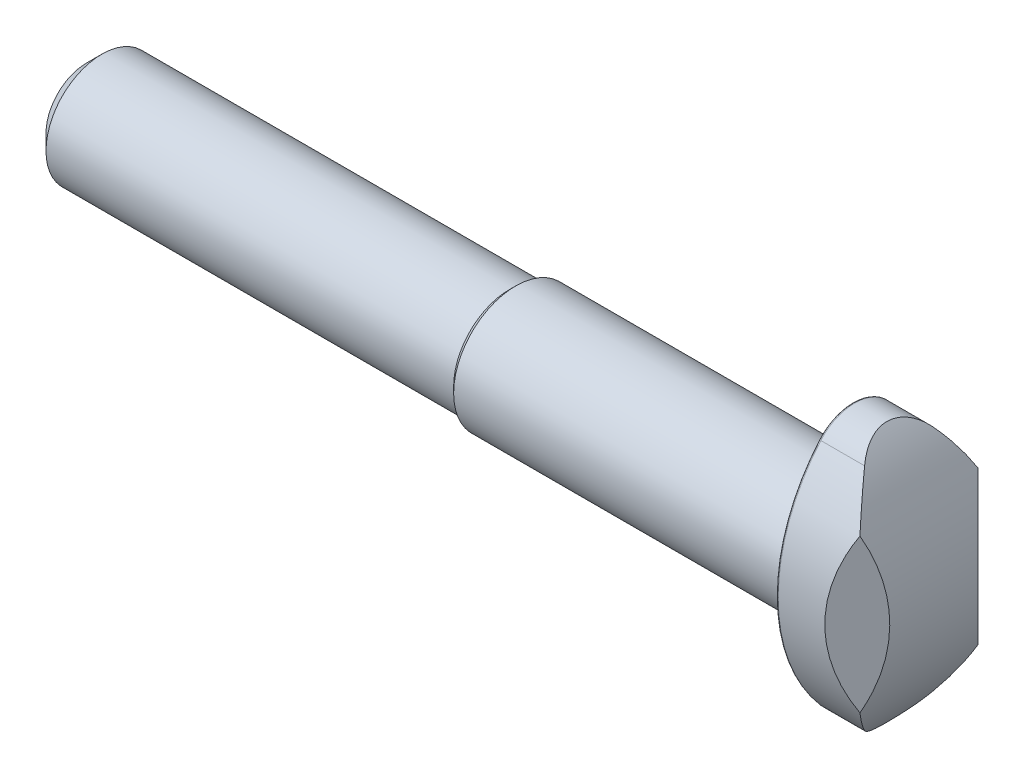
ISO-10303-21;
HEADER;
FILE_DESCRIPTION(('STEP AP214'),'2;1');
FILE_NAME('part.step','',(''),(''),'','','');
FILE_SCHEMA(('AUTOMOTIVE_DESIGN { 1 0 10303 214 1 1 1 1 }'));
ENDSEC;
DATA;
#1=APPLICATION_CONTEXT('core data for automotive mechanical design processes');
#2=APPLICATION_PROTOCOL_DEFINITION('international standard','automotive_design',2000,#1);
#3=PRODUCT_CONTEXT('',#1,'mechanical');
#4=PRODUCT('Part','Part','',(#3));
#5=PRODUCT_RELATED_PRODUCT_CATEGORY('part','',(#4));
#6=PRODUCT_DEFINITION_FORMATION('','',#4);
#7=PRODUCT_DEFINITION_CONTEXT('part definition',#1,'design');
#8=PRODUCT_DEFINITION('design','',#6,#7);
#9=PRODUCT_DEFINITION_SHAPE('','',#8);
#10=(LENGTH_UNIT() NAMED_UNIT(*) SI_UNIT(.MILLI.,.METRE.));
#11=(NAMED_UNIT(*) PLANE_ANGLE_UNIT() SI_UNIT($,.RADIAN.));
#12=(NAMED_UNIT(*) SI_UNIT($,.STERADIAN.) SOLID_ANGLE_UNIT());
#13=UNCERTAINTY_MEASURE_WITH_UNIT(LENGTH_MEASURE(1.E-05),#10,'distance_accuracy_value','');
#14=(GEOMETRIC_REPRESENTATION_CONTEXT(3) GLOBAL_UNCERTAINTY_ASSIGNED_CONTEXT((#13)) GLOBAL_UNIT_ASSIGNED_CONTEXT((#10,
#11,#12)) REPRESENTATION_CONTEXT('',''));
#15=CARTESIAN_POINT('',(0.,0.,0.));
#16=DIRECTION('',(0.,0.,1.));
#17=DIRECTION('',(1.,0.,0.));
#18=AXIS2_PLACEMENT_3D('',#15,#16,#17);
#19=CARTESIAN_POINT('',(5.349824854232,5.196582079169,-2.828854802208));
#20=DIRECTION('',(-0.707106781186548,0.,0.707106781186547));
#21=DIRECTION('',(-0.707106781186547,0.,-0.707106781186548));
#22=AXIS2_PLACEMENT_3D('',#19,#20,#21);
#23=PLANE('',#22);
#24=CARTESIAN_POINT('',(14.63567965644,0.,6.457));
#25=DIRECTION('',(-0.707106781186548,0.,0.707106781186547));
#26=DIRECTION('',(0.707106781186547,0.,0.707106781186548));
#27=AXIS2_PLACEMENT_3D('',#24,#25,#26);
#28=ELLIPSE('',#27,16.2026447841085,11.457);
#29=CARTESIAN_POINT('',(4.32569891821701,-4.99671353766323,-3.85298073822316));
#30=VERTEX_POINT('',#29);
#31=CARTESIAN_POINT('',(4.32569891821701,4.99671353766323,-3.85298073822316));
#32=VERTEX_POINT('',#31);
#33=EDGE_CURVE('E110',#30,#32,#28,.F.);
#34=ORIENTED_EDGE('',*,*,#33,.T.);
#35=CARTESIAN_POINT('',(-8.,0.,-16.17867965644));
#36=DIRECTION('',(-0.707106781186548,0.,0.707106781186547));
#37=DIRECTION('',(0.707106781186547,0.,0.707106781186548));
#38=AXIS2_PLACEMENT_3D('',#35,#36,#37);
#39=ELLIPSE('',#38,18.8090403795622,13.3);
#40=EDGE_CURVE('E112',#32,#30,#39,.F.);
#41=ORIENTED_EDGE('',*,*,#40,.T.);
#42=EDGE_LOOP('',(#34,#41));
#43=FACE_BOUND('',#42,.T.);
#44=ADVANCED_FACE('F44',(#43),#23,.F.);
#45=CARTESIAN_POINT('',(3.128854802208,5.196582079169,5.049824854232));
#46=DIRECTION('',(-0.707106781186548,0.,-0.707106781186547));
#47=DIRECTION('',(0.707106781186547,0.,-0.707106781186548));
#48=AXIS2_PLACEMENT_3D('',#45,#46,#47);
#49=PLANE('',#48);
#50=CARTESIAN_POINT('',(14.63567965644,0.,-6.457));
#51=DIRECTION('',(-0.707106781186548,0.,-0.707106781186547));
#52=DIRECTION('',(0.707106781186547,0.,-0.707106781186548));
#53=AXIS2_PLACEMENT_3D('',#50,#51,#52);
#54=ELLIPSE('',#53,16.2026447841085,11.457);
#55=CARTESIAN_POINT('',(4.32569891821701,4.99671353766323,3.85298073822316));
#56=VERTEX_POINT('',#55);
#57=CARTESIAN_POINT('',(4.32569891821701,-4.99671353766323,3.85298073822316));
#58=VERTEX_POINT('',#57);
#59=EDGE_CURVE('E137',#56,#58,#54,.F.);
#60=ORIENTED_EDGE('',*,*,#59,.T.);
#61=CARTESIAN_POINT('',(-8.,0.,16.17867965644));
#62=DIRECTION('',(-0.707106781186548,0.,-0.707106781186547));
#63=DIRECTION('',(-0.707106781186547,0.,0.707106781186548));
#64=AXIS2_PLACEMENT_3D('',#61,#62,#63);
#65=ELLIPSE('',#64,18.8090403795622,13.3);
#66=EDGE_CURVE('E124',#58,#56,#65,.F.);
#67=ORIENTED_EDGE('',*,*,#66,.T.);
#68=EDGE_LOOP('',(#60,#67));
#69=FACE_BOUND('',#68,.T.);
#70=ADVANCED_FACE('F255',(#69),#49,.F.);
#71=CARTESIAN_POINT('',(-8.,0.,-3.89921650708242));
#72=DIRECTION('',(0.,0.,1.));
#73=DIRECTION('',(1.,0.,0.));
#74=AXIS2_PLACEMENT_3D('',#71,#72,#73);
#75=CYLINDRICAL_SURFACE('',#74,13.3);
#76=CARTESIAN_POINT('',(4.32569891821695,4.9967135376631,-3.85298073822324));
#77=CARTESIAN_POINT('',(4.23138338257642,5.22939520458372,-3.74021199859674));
#78=CARTESIAN_POINT('',(4.13167659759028,5.45640019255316,-3.62046863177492));
#79=CARTESIAN_POINT('',(3.92299290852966,5.89846110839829,-3.36825783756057));
#80=CARTESIAN_POINT('',(3.81402504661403,6.11352836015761,-3.23580280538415));
#81=CARTESIAN_POINT('',(3.59009589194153,6.52795648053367,-2.96156227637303));
#82=CARTESIAN_POINT('',(3.47527072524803,6.72752455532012,-2.81997759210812));
#83=CARTESIAN_POINT('',(3.23920653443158,7.11489296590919,-2.52633109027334));
#84=CARTESIAN_POINT('',(3.11796540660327,7.30268939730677,-2.374265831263));
#85=CARTESIAN_POINT('',(2.80793513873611,7.7580928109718,-1.9813292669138));
#86=CARTESIAN_POINT('',(2.61589582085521,8.01822735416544,-1.73432298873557));
#87=CARTESIAN_POINT('',(2.22437765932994,8.51183620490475,-1.22014873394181));
#88=CARTESIAN_POINT('',(2.02489521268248,8.74529737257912,-0.952970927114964));
#89=CARTESIAN_POINT('',(1.72084827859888,9.07846687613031,-0.53422518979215));
#90=CARTESIAN_POINT('',(1.61730684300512,9.18800238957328,-0.38962991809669));
#91=CARTESIAN_POINT('',(1.41013590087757,9.40006966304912,-0.0954362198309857));
#92=CARTESIAN_POINT('',(1.30650639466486,9.50260144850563,0.0541621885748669));
#93=CARTESIAN_POINT('',(1.0999802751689,9.70055580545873,0.358232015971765));
#94=CARTESIAN_POINT('',(0.997083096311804,9.79598456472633,0.512699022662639));
#95=CARTESIAN_POINT('',(0.792775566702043,9.97978163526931,0.826739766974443));
#96=CARTESIAN_POINT('',(0.691365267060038,10.0681497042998,0.98631367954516));
#97=CARTESIAN_POINT('',(0.591125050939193,10.1529586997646,1.14848997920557));
#98=B_SPLINE_CURVE_WITH_KNOTS('',3,(#76,#77,#78,#79,#80,#81,#82,#83,#84,#85,#86,#87,#88,#89,#90,
#91,#92,#93,#94,#95,#96,#97),.UNSPECIFIED.,.F.,.F.,(4,2,2,2,2,2,2,2,2,2,4),(0.,
0.825362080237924,1.64992736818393,2.46024231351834,3.27082461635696,4.4898934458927,
5.7095602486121,6.33602294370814,6.96248336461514,7.58839150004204,8.21432110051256),.UNSPECIFIED.);
#99=CARTESIAN_POINT('',(2.99414853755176,7.48456397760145,-2.21733865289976));
#100=VERTEX_POINT('',#99);
#101=EDGE_CURVE('E117',#32,#100,#98,.T.);
#102=ORIENTED_EDGE('',*,*,#101,.T.);
#103=CARTESIAN_POINT('',(2.99414853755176,7.48456397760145,-2.21733865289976));
#104=CARTESIAN_POINT('',(2.95346059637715,7.54433446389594,-2.16574912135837));
#105=CARTESIAN_POINT('',(2.91333407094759,7.60222400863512,-2.11159670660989));
#106=CARTESIAN_POINT('',(2.83462441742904,7.71398640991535,-1.99811533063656));
#107=CARTESIAN_POINT('',(2.79604307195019,7.76785468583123,-1.93878062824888));
#108=CARTESIAN_POINT('',(2.6828967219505,7.92352080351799,-1.75230440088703));
#109=CARTESIAN_POINT('',(2.61147146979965,8.01859302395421,-1.61736226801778));
#110=CARTESIAN_POINT('',(2.49373795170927,8.17185045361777,-1.35401498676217));
#111=CARTESIAN_POINT('',(2.44522157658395,8.2335837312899,-1.22865030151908));
#112=CARTESIAN_POINT('',(2.36095034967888,8.33938250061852,-0.966836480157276));
#113=CARTESIAN_POINT('',(2.32515891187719,8.38349868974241,-0.830420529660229));
#114=CARTESIAN_POINT('',(2.28328839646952,8.43471754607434,-0.619243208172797));
#115=CARTESIAN_POINT('',(2.27127127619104,8.44933259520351,-0.547385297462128));
#116=CARTESIAN_POINT('',(2.25160757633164,8.47318032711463,-0.402206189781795));
#117=CARTESIAN_POINT('',(2.24395880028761,8.48241571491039,-0.328885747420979));
#118=CARTESIAN_POINT('',(2.23326535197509,8.4953135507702,-0.181404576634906));
#119=CARTESIAN_POINT('',(2.23022159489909,8.4989748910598,-0.107243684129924));
#120=CARTESIAN_POINT('',(2.22882712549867,8.50065232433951,0.0411613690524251));
#121=CARTESIAN_POINT('',(2.23047588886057,8.49866904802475,0.11540551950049));
#122=CARTESIAN_POINT('',(2.24138913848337,8.48552367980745,0.318053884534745));
#123=CARTESIAN_POINT('',(2.25538446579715,8.46865763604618,0.445901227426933));
#124=CARTESIAN_POINT('',(2.29624756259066,8.4189242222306,0.696155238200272));
#125=CARTESIAN_POINT('',(2.3231140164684,8.38605848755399,0.818562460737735));
#126=CARTESIAN_POINT('',(2.38861158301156,8.30479002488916,1.05920720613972));
#127=CARTESIAN_POINT('',(2.42758066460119,8.25593845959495,1.177198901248));
#128=CARTESIAN_POINT('',(2.514492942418,8.14496252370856,1.40335746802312));
#129=CARTESIAN_POINT('',(2.56245057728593,8.08281677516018,1.51150811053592));
#130=CARTESIAN_POINT('',(2.67089046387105,7.93920907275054,1.72891295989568));
#131=CARTESIAN_POINT('',(2.7321811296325,7.85633955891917,1.83682448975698));
#132=CARTESIAN_POINT('',(2.8599248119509,7.67881281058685,2.03800330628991));
#133=CARTESIAN_POINT('',(2.92635275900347,7.58421160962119,2.13133573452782));
#134=CARTESIAN_POINT('',(2.99414853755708,7.48456397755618,2.21733865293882));
#135=B_SPLINE_CURVE_WITH_KNOTS('',3,(#103,#104,#105,#106,#107,#108,#109,#110,#111,#112,#113,
#114,#115,#116,#117,#118,#119,#120,#121,#122,#123,#124,#125,#126,#127,#128,#129,#130,#131,#132,
#133,#134),.UNSPECIFIED.,.F.,.F.,(4,2,2,2,2,2,2,2,2,2,2,2,2,2,2,4),(0.,0.266329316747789,
0.532957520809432,1.0696814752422,1.51179794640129,1.95263278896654,2.17527144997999,
2.39779806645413,2.62036890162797,2.8429148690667,3.23006182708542,3.61716922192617,
4.01624181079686,4.41596102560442,4.86230380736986,5.30659140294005),.UNSPECIFIED.);
#136=CARTESIAN_POINT('',(2.99414853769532,7.48456397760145,2.21733865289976));
#137=VERTEX_POINT('',#136);
#138=EDGE_CURVE('E262',#100,#137,#135,.T.);
#139=ORIENTED_EDGE('',*,*,#138,.T.);
#140=CARTESIAN_POINT('',(0.591125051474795,10.1529586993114,-1.14848997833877));
#141=CARTESIAN_POINT('',(0.691365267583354,10.0681497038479,-0.98631367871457));
#142=CARTESIAN_POINT('',(0.792775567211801,9.97978163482,-0.826739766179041));
#143=CARTESIAN_POINT('',(0.997083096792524,9.79598456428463,-0.512699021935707));
#144=CARTESIAN_POINT('',(1.09998027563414,9.70055580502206,-0.358232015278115));
#145=CARTESIAN_POINT('',(1.3065063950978,9.50260144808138,-0.0541621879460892));
#146=CARTESIAN_POINT('',(1.41013590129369,9.40006966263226,0.095436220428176));
#147=CARTESIAN_POINT('',(1.61730684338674,9.18800238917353,0.389629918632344));
#148=CARTESIAN_POINT('',(1.72084827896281,9.07846687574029,0.534225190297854));
#149=CARTESIAN_POINT('',(2.02489521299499,8.74529737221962,0.95297092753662));
#150=CARTESIAN_POINT('',(2.22437765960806,8.51183620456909,1.22014873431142));
#151=CARTESIAN_POINT('',(2.6158958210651,8.01822735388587,1.73432298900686));
#152=CARTESIAN_POINT('',(2.80793513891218,7.75809281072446,1.98132926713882));
#153=CARTESIAN_POINT('',(3.11796540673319,7.30268939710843,2.37426583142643));
#154=CARTESIAN_POINT('',(3.23920653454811,7.11489296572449,2.52633109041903));
#155=CARTESIAN_POINT('',(3.47527072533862,6.72752455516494,2.81997759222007));
#156=CARTESIAN_POINT('',(3.59009589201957,6.52795648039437,2.96156227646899));
#157=CARTESIAN_POINT('',(3.81402504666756,6.1135283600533,3.23580280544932));
#158=CARTESIAN_POINT('',(3.92299290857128,5.89846110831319,3.36825783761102));
#159=CARTESIAN_POINT('',(4.13167659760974,5.45640019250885,3.62046863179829));
#160=CARTESIAN_POINT('',(4.23138338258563,5.22939520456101,3.74021199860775));
#161=CARTESIAN_POINT('',(4.32569891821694,4.9967135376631,3.85298073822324));
#162=B_SPLINE_CURVE_WITH_KNOTS('',3,(#140,#141,#142,#143,#144,#145,#146,#147,#148,#149,#150,
#151,#152,#153,#154,#155,#156,#157,#158,#159,#160,#161),.UNSPECIFIED.,.F.,.F.,(4,2,2,2,2,2,2,2,
2,2,4),(0.,0.625929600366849,1.25183773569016,1.87829815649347,2.50476085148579,
3.72442765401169,4.94349648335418,5.75407878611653,6.56439373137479,7.38895901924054,
8.21432109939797),.UNSPECIFIED.);
#163=EDGE_CURVE('E131',#137,#56,#162,.T.);
#164=ORIENTED_EDGE('',*,*,#163,.T.);
#165=ORIENTED_EDGE('',*,*,#66,.F.);
#166=CARTESIAN_POINT('',(4.32569891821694,-4.9967135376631,3.85298073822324));
#167=CARTESIAN_POINT('',(4.23138338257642,-5.22939520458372,3.74021199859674));
#168=CARTESIAN_POINT('',(4.13167659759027,-5.45640019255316,3.62046863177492));
#169=CARTESIAN_POINT('',(3.92299290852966,-5.89846110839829,3.36825783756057));
#170=CARTESIAN_POINT('',(3.81402504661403,-6.1135283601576,3.23580280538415));
#171=CARTESIAN_POINT('',(3.59009589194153,-6.52795648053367,2.96156227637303));
#172=CARTESIAN_POINT('',(3.47527072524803,-6.72752455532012,2.81997759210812));
#173=CARTESIAN_POINT('',(3.23920653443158,-7.11489296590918,2.52633109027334));
#174=CARTESIAN_POINT('',(3.11796540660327,-7.30268939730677,2.37426583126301));
#175=CARTESIAN_POINT('',(2.8079351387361,-7.75809281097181,1.98132926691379));
#176=CARTESIAN_POINT('',(2.6158958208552,-8.01822735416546,1.73432298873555));
#177=CARTESIAN_POINT('',(2.22437765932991,-8.51183620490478,1.22014873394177));
#178=CARTESIAN_POINT('',(2.02489521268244,-8.74529737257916,0.952970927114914));
#179=CARTESIAN_POINT('',(1.72084827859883,-9.07846687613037,0.534225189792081));
#180=CARTESIAN_POINT('',(1.61730684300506,-9.18800238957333,0.389629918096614));
#181=CARTESIAN_POINT('',(1.41013590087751,-9.40006966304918,0.0954362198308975));
#182=CARTESIAN_POINT('',(1.30650639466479,-9.50260144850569,-0.0541621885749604));
#183=CARTESIAN_POINT('',(1.09998027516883,-9.7005558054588,-0.358232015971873));
#184=CARTESIAN_POINT('',(0.997083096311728,-9.7959845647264,-0.512699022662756));
#185=CARTESIAN_POINT('',(0.792775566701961,-9.97978163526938,-0.826739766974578));
#186=CARTESIAN_POINT('',(0.691365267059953,-10.0681497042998,-0.986313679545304));
#187=CARTESIAN_POINT('',(0.591125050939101,-10.1529586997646,-1.14848997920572));
#188=B_SPLINE_CURVE_WITH_KNOTS('',3,(#166,#167,#168,#169,#170,#171,#172,#173,#174,#175,#176,
#177,#178,#179,#180,#181,#182,#183,#184,#185,#186,#187),.UNSPECIFIED.,.F.,.F.,(4,2,2,2,2,2,2,2,
2,2,4),(0.,0.825362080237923,1.64992736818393,2.46024231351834,3.27082461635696,
4.48989344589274,5.70956024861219,6.33602294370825,6.96248336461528,7.5883915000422,
8.21432110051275),.UNSPECIFIED.);
#189=CARTESIAN_POINT('',(2.99414853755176,-7.48456397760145,2.21733865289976));
#190=VERTEX_POINT('',#189);
#191=EDGE_CURVE('E190',#58,#190,#188,.T.);
#192=ORIENTED_EDGE('',*,*,#191,.T.);
#193=CARTESIAN_POINT('',(2.99414853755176,-7.48456397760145,2.21733865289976));
#194=CARTESIAN_POINT('',(2.95346059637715,-7.54433446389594,2.16574912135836));
#195=CARTESIAN_POINT('',(2.91333407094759,-7.60222400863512,2.11159670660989));
#196=CARTESIAN_POINT('',(2.83462441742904,-7.71398640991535,1.99811533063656));
#197=CARTESIAN_POINT('',(2.79604307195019,-7.76785468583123,1.93878062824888));
#198=CARTESIAN_POINT('',(2.6828967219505,-7.923520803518,1.75230440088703));
#199=CARTESIAN_POINT('',(2.61147146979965,-8.01859302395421,1.61736226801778));
#200=CARTESIAN_POINT('',(2.49373795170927,-8.17185045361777,1.35401498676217));
#201=CARTESIAN_POINT('',(2.44522157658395,-8.2335837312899,1.22865030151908));
#202=CARTESIAN_POINT('',(2.36095034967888,-8.33938250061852,0.966836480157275));
#203=CARTESIAN_POINT('',(2.32515891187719,-8.38349868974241,0.830420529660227));
#204=CARTESIAN_POINT('',(2.28328839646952,-8.43471754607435,0.619243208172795));
#205=CARTESIAN_POINT('',(2.27127127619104,-8.44933259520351,0.547385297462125));
#206=CARTESIAN_POINT('',(2.25160757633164,-8.47318032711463,0.402206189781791));
#207=CARTESIAN_POINT('',(2.24395880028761,-8.48241571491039,0.328885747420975));
#208=CARTESIAN_POINT('',(2.23326535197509,-8.4953135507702,0.181404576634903));
#209=CARTESIAN_POINT('',(2.23022159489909,-8.4989748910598,0.10724368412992));
#210=CARTESIAN_POINT('',(2.22882712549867,-8.50065232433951,-0.0411613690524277));
#211=CARTESIAN_POINT('',(2.23047588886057,-8.49866904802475,-0.115405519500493));
#212=CARTESIAN_POINT('',(2.24138913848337,-8.48552367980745,-0.318053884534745));
#213=CARTESIAN_POINT('',(2.25538446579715,-8.46865763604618,-0.445901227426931));
#214=CARTESIAN_POINT('',(2.29624756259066,-8.4189242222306,-0.696155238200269));
#215=CARTESIAN_POINT('',(2.3231140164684,-8.38605848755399,-0.818562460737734));
#216=CARTESIAN_POINT('',(2.38861158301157,-8.30479002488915,-1.05920720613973));
#217=CARTESIAN_POINT('',(2.42758066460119,-8.25593845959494,-1.17719890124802));
#218=CARTESIAN_POINT('',(2.51449294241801,-8.14496252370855,-1.40335746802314));
#219=CARTESIAN_POINT('',(2.56245057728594,-8.08281677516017,-1.51150811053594));
#220=CARTESIAN_POINT('',(2.67089046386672,-7.93920907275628,-1.728912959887));
#221=CARTESIAN_POINT('',(2.73218112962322,-7.85633955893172,-1.83682448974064));
#222=CARTESIAN_POINT('',(2.85992481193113,-7.67881281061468,-2.03800330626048));
#223=CARTESIAN_POINT('',(2.92635275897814,-7.58421160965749,-2.13133573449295));
#224=CARTESIAN_POINT('',(2.99414853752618,-7.48456397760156,-2.21733865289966));
#225=B_SPLINE_CURVE_WITH_KNOTS('',3,(#193,#194,#195,#196,#197,#198,#199,#200,#201,#202,#203,
#204,#205,#206,#207,#208,#209,#210,#211,#212,#213,#214,#215,#216,#217,#218,#219,#220,#221,#222,
#223,#224),.UNSPECIFIED.,.F.,.F.,(4,2,2,2,2,2,2,2,2,2,2,2,2,2,2,4),(0.,0.26632931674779,
0.532957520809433,1.0696814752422,1.51179794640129,1.95263278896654,2.17527144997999,
2.39779806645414,2.62036890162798,2.8429148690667,3.23006182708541,3.61716922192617,
4.01624181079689,4.41596102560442,4.8623038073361,5.30659140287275),.UNSPECIFIED.);
#226=CARTESIAN_POINT('',(2.99414853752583,-7.48456397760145,-2.21733865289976));
#227=VERTEX_POINT('',#226);
#228=EDGE_CURVE('E264',#190,#227,#225,.T.);
#229=ORIENTED_EDGE('',*,*,#228,.T.);
#230=CARTESIAN_POINT('',(0.591125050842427,-10.1529586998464,1.14848997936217));
#231=CARTESIAN_POINT('',(0.691365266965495,-10.0681497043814,0.986313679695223));
#232=CARTESIAN_POINT('',(0.792775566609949,-9.97978163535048,0.826739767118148));
#233=CARTESIAN_POINT('',(0.997083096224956,-9.79598456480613,0.51269902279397));
#234=CARTESIAN_POINT('',(1.09998027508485,-9.70055580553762,0.35823201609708));
#235=CARTESIAN_POINT('',(1.30650639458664,-9.50260144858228,0.0541621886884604));
#236=CARTESIAN_POINT('',(1.41013590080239,-9.40006966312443,-0.095436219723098));
#237=CARTESIAN_POINT('',(1.61730684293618,-9.1880023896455,-0.38962991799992));
#238=CARTESIAN_POINT('',(1.72084827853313,-9.07846687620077,-0.534225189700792));
#239=CARTESIAN_POINT('',(2.02489521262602,-8.74529737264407,-0.952970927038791));
#240=CARTESIAN_POINT('',(2.22437765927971,-8.51183620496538,-1.22014873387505));
#241=CARTESIAN_POINT('',(2.6158958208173,-8.01822735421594,-1.73432298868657));
#242=CARTESIAN_POINT('',(2.8079351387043,-7.75809281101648,-1.98132926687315));
#243=CARTESIAN_POINT('',(3.1179654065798,-7.30268939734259,-2.37426583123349));
#244=CARTESIAN_POINT('',(3.23920653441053,-7.11489296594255,-2.52633109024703));
#245=CARTESIAN_POINT('',(3.47527072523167,-6.72752455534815,-2.8199775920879));
#246=CARTESIAN_POINT('',(3.59009589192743,-6.52795648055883,-2.9615622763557));
#247=CARTESIAN_POINT('',(3.81402504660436,-6.11352836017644,-3.23580280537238));
#248=CARTESIAN_POINT('',(3.92299290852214,-5.89846110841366,-3.36825783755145));
#249=CARTESIAN_POINT('',(4.13167659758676,-5.45640019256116,-3.6204686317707));
#250=CARTESIAN_POINT('',(4.23138338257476,-5.22939520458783,-3.74021199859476));
#251=CARTESIAN_POINT('',(4.32569891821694,-4.9967135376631,-3.85298073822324));
#252=B_SPLINE_CURVE_WITH_KNOTS('',3,(#230,#231,#232,#233,#234,#235,#236,#237,#238,#239,#240,
#241,#242,#243,#244,#245,#246,#247,#248,#249,#250,#251),.UNSPECIFIED.,.F.,.F.,(4,2,2,2,2,2,2,2,
2,2,4),(0.,0.625929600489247,1.25183773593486,1.8782981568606,2.50476085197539,3.72442765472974,
4.9434964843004,5.7540787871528,6.56439373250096,7.38895902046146,8.21432110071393),.UNSPECIFIED.);
#253=EDGE_CURVE('E118',#227,#30,#252,.T.);
#254=ORIENTED_EDGE('',*,*,#253,.T.);
#255=ORIENTED_EDGE('',*,*,#40,.F.);
#256=EDGE_LOOP('',(#102,#139,#164,#165,#192,#229,#254,#255));
#257=FACE_BOUND('',#256,.T.);
#258=ADVANCED_FACE('F122',(#257),#75,.T.);
#259=CARTESIAN_POINT('',(0.14,0.,6.457));
#260=DIRECTION('',(1.,0.,0.));
#261=DIRECTION('',(0.,0.,-1.));
#262=AXIS2_PLACEMENT_3D('',#259,#260,#261);
#263=CYLINDRICAL_SURFACE('',#262,11.457);
#264=DIRECTION('',(1.,0.,0.));
#265=VECTOR('',#264,1.);
#266=CARTESIAN_POINT('',(0.14,-7.48456397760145,-2.21733865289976));
#267=LINE('',#266,#265);
#268=CARTESIAN_POINT('',(0.139999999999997,-7.48456397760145,-2.21733865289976));
#269=VERTEX_POINT('',#268);
#270=EDGE_CURVE('E197',#227,#269,#267,.F.);
#271=ORIENTED_EDGE('',*,*,#270,.T.);
#272=CARTESIAN_POINT('',(0.139999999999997,0.,6.457));
#273=DIRECTION('',(1.,0.,0.));
#274=DIRECTION('',(0.,0.,-1.));
#275=AXIS2_PLACEMENT_3D('',#272,#273,#274);
#276=CIRCLE('',#275,11.457);
#277=CARTESIAN_POINT('',(0.139999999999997,7.48456397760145,-2.21733865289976));
#278=VERTEX_POINT('',#277);
#279=EDGE_CURVE('E479',#269,#278,#276,.T.);
#280=ORIENTED_EDGE('',*,*,#279,.T.);
#281=DIRECTION('',(1.,0.,0.));
#282=VECTOR('',#281,1.);
#283=CARTESIAN_POINT('',(0.14,7.48456397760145,-2.21733865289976));
#284=LINE('',#283,#282);
#285=EDGE_CURVE('E128',#278,#100,#284,.T.);
#286=ORIENTED_EDGE('',*,*,#285,.T.);
#287=ORIENTED_EDGE('',*,*,#101,.F.);
#288=ORIENTED_EDGE('',*,*,#33,.F.);
#289=ORIENTED_EDGE('',*,*,#253,.F.);
#290=EDGE_LOOP('',(#271,#280,#286,#287,#288,#289));
#291=FACE_BOUND('',#290,.T.);
#292=ADVANCED_FACE('F126',(#291),#263,.T.);
#293=CARTESIAN_POINT('',(0.14,0.,-6.457));
#294=DIRECTION('',(1.,0.,0.));
#295=DIRECTION('',(0.,0.,-1.));
#296=AXIS2_PLACEMENT_3D('',#293,#294,#295);
#297=CYLINDRICAL_SURFACE('',#296,11.457);
#298=DIRECTION('',(1.,0.,0.));
#299=VECTOR('',#298,1.);
#300=CARTESIAN_POINT('',(0.14,7.48456397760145,2.21733865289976));
#301=LINE('',#300,#299);
#302=CARTESIAN_POINT('',(0.139999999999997,7.48456397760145,2.21733865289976));
#303=VERTEX_POINT('',#302);
#304=EDGE_CURVE('E261',#137,#303,#301,.F.);
#305=ORIENTED_EDGE('',*,*,#304,.T.);
#306=CARTESIAN_POINT('',(0.139999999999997,0.,-6.457));
#307=DIRECTION('',(1.,0.,0.));
#308=DIRECTION('',(0.,0.,-1.));
#309=AXIS2_PLACEMENT_3D('',#306,#307,#308);
#310=CIRCLE('',#309,11.457);
#311=CARTESIAN_POINT('',(0.139999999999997,-7.48456397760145,2.21733865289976));
#312=VERTEX_POINT('',#311);
#313=EDGE_CURVE('E53',#303,#312,#310,.T.);
#314=ORIENTED_EDGE('',*,*,#313,.T.);
#315=DIRECTION('',(1.,0.,0.));
#316=VECTOR('',#315,1.);
#317=CARTESIAN_POINT('',(0.14,-7.48456397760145,2.21733865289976));
#318=LINE('',#317,#316);
#319=EDGE_CURVE('E259',#312,#190,#318,.T.);
#320=ORIENTED_EDGE('',*,*,#319,.T.);
#321=ORIENTED_EDGE('',*,*,#191,.F.);
#322=ORIENTED_EDGE('',*,*,#59,.F.);
#323=ORIENTED_EDGE('',*,*,#163,.F.);
#324=EDGE_LOOP('',(#305,#314,#320,#321,#322,#323));
#325=FACE_BOUND('',#324,.T.);
#326=ADVANCED_FACE('F158',(#325),#297,.T.);
#327=CARTESIAN_POINT('',(0.,0.,0.));
#328=DIRECTION('',(1.,0.,0.));
#329=DIRECTION('',(0.,0.,-1.));
#330=AXIS2_PLACEMENT_3D('',#327,#328,#329);
#331=PLANE('',#330);
#332=CARTESIAN_POINT('',(0.,0.,-6.457));
#333=DIRECTION('',(1.,0.,0.));
#334=DIRECTION('',(0.,0.,-1.));
#335=AXIS2_PLACEMENT_3D('',#332,#333,#334);
#336=CIRCLE('',#335,11.317);
#337=CARTESIAN_POINT('',(0.,-7.39310557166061,2.111341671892));
#338=VERTEX_POINT('',#337);
#339=CARTESIAN_POINT('',(0.,7.39310557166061,2.111341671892));
#340=VERTEX_POINT('',#339);
#341=EDGE_CURVE('E469',#338,#340,#336,.F.);
#342=ORIENTED_EDGE('',*,*,#341,.T.);
#343=CARTESIAN_POINT('',(0.,5.57135610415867,0.));
#344=DIRECTION('',(1.,0.,0.));
#345=DIRECTION('',(0.,0.,-1.));
#346=AXIS2_PLACEMENT_3D('',#343,#344,#345);
#347=CIRCLE('',#346,2.788643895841);
#348=CARTESIAN_POINT('',(0.,7.39310557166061,-2.111341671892));
#349=VERTEX_POINT('',#348);
#350=EDGE_CURVE('E473',#340,#349,#347,.F.);
#351=ORIENTED_EDGE('',*,*,#350,.T.);
#352=CARTESIAN_POINT('',(0.,0.,6.457));
#353=DIRECTION('',(1.,0.,0.));
#354=DIRECTION('',(0.,0.,-1.));
#355=AXIS2_PLACEMENT_3D('',#352,#353,#354);
#356=CIRCLE('',#355,11.317);
#357=CARTESIAN_POINT('',(0.,-7.39310557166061,-2.111341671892));
#358=VERTEX_POINT('',#357);
#359=EDGE_CURVE('E471',#349,#358,#356,.F.);
#360=ORIENTED_EDGE('',*,*,#359,.T.);
#361=CARTESIAN_POINT('',(0.,-5.57135610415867,0.));
#362=DIRECTION('',(1.,0.,0.));
#363=DIRECTION('',(0.,0.,-1.));
#364=AXIS2_PLACEMENT_3D('',#361,#362,#363);
#365=CIRCLE('',#364,2.788643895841);
#366=EDGE_CURVE('E464',#358,#338,#365,.F.);
#367=ORIENTED_EDGE('',*,*,#366,.T.);
#368=EDGE_LOOP('',(#342,#351,#360,#367));
#369=FACE_BOUND('',#368,.T.);
#370=CARTESIAN_POINT('',(0.,0.,0.));
#371=DIRECTION('',(-1.,0.,0.));
#372=DIRECTION('',(0.,0.,1.));
#373=AXIS2_PLACEMENT_3D('',#370,#371,#372);
#374=CIRCLE('',#373,4.045);
#375=CARTESIAN_POINT('',(0.,0.,4.045));
#376=VERTEX_POINT('',#375);
#377=EDGE_CURVE('E198',#376,#376,#374,.T.);
#378=ORIENTED_EDGE('',*,*,#377,.F.);
#379=EDGE_LOOP('',(#378));
#380=FACE_BOUND('',#379,.T.);
#381=ADVANCED_FACE('F304',(#369,#380),#331,.F.);
#382=CARTESIAN_POINT('',(0.,0.,0.));
#383=DIRECTION('',(-1.,0.,0.));
#384=DIRECTION('',(0.,0.,1.));
#385=AXIS2_PLACEMENT_3D('',#382,#383,#384);
#386=CYLINDRICAL_SURFACE('',#385,4.045);
#387=ORIENTED_EDGE('',*,*,#377,.T.);
#388=EDGE_LOOP('',(#387));
#389=FACE_BOUND('',#388,.T.);
#390=CARTESIAN_POINT('',(-22.0000000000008,0.,0.));
#391=DIRECTION('',(-1.,0.,0.));
#392=DIRECTION('',(0.,0.,1.));
#393=AXIS2_PLACEMENT_3D('',#390,#391,#392);
#394=CIRCLE('',#393,4.045);
#395=CARTESIAN_POINT('',(-22.0000000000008,0.,4.045));
#396=VERTEX_POINT('',#395);
#397=EDGE_CURVE('E490',#396,#396,#394,.T.);
#398=ORIENTED_EDGE('',*,*,#397,.F.);
#399=EDGE_LOOP('',(#398));
#400=FACE_BOUND('',#399,.T.);
#401=ADVANCED_FACE('F308',(#389,#400),#386,.T.);
#402=CARTESIAN_POINT('',(-50.,0.,0.));
#403=DIRECTION('',(-1.,0.,0.));
#404=DIRECTION('',(0.,0.,1.));
#405=AXIS2_PLACEMENT_3D('',#402,#403,#404);
#406=PLANE('',#405);
#407=CARTESIAN_POINT('',(-50.,0.,0.));
#408=DIRECTION('',(-1.,0.,0.));
#409=DIRECTION('',(0.,0.,1.));
#410=AXIS2_PLACEMENT_3D('',#407,#408,#409);
#411=CIRCLE('',#410,2.65000000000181);
#412=CARTESIAN_POINT('',(-50.,0.,2.65000000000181));
#413=VERTEX_POINT('',#412);
#414=EDGE_CURVE('E459',#413,#413,#411,.T.);
#415=ORIENTED_EDGE('',*,*,#414,.T.);
#416=EDGE_LOOP('',(#415));
#417=FACE_BOUND('',#416,.T.);
#418=ADVANCED_FACE('F313',(#417),#406,.T.);
#419=CARTESIAN_POINT('',(0.,0.,0.));
#420=DIRECTION('',(-1.,0.,0.));
#421=DIRECTION('',(0.,0.,1.));
#422=AXIS2_PLACEMENT_3D('',#419,#420,#421);
#423=CYLINDRICAL_SURFACE('',#422,3.6499999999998);
#424=CARTESIAN_POINT('',(-48.9999999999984,0.,0.));
#425=DIRECTION('',(-1.,0.,0.));
#426=DIRECTION('',(0.,0.,1.));
#427=AXIS2_PLACEMENT_3D('',#424,#425,#426);
#428=CIRCLE('',#427,3.6499999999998);
#429=CARTESIAN_POINT('',(-48.9999999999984,0.,3.6499999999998));
#430=VERTEX_POINT('',#429);
#431=EDGE_CURVE('E461',#430,#430,#428,.F.);
#432=ORIENTED_EDGE('',*,*,#431,.T.);
#433=EDGE_LOOP('',(#432));
#434=FACE_BOUND('',#433,.T.);
#435=CARTESIAN_POINT('',(-22.3950000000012,0.,0.));
#436=DIRECTION('',(-1.,0.,0.));
#437=DIRECTION('',(0.,0.,1.));
#438=AXIS2_PLACEMENT_3D('',#435,#436,#437);
#439=CIRCLE('',#438,3.6499999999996);
#440=CARTESIAN_POINT('',(-22.3950000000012,0.,3.6499999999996));
#441=VERTEX_POINT('',#440);
#442=EDGE_CURVE('E494',#441,#441,#439,.T.);
#443=ORIENTED_EDGE('',*,*,#442,.T.);
#444=EDGE_LOOP('',(#443));
#445=FACE_BOUND('',#444,.T.);
#446=ADVANCED_FACE('F395',(#434,#445),#423,.T.);
#447=CARTESIAN_POINT('',(-22.3950000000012,0.,0.));
#448=DIRECTION('',(1.,0.,0.));
#449=DIRECTION('',(0.,0.,-1.));
#450=AXIS2_PLACEMENT_3D('',#447,#448,#449);
#451=CONICAL_SURFACE('',#450,3.6499999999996,0.785398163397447);
#452=ORIENTED_EDGE('',*,*,#397,.T.);
#453=EDGE_LOOP('',(#452));
#454=FACE_BOUND('',#453,.T.);
#455=ORIENTED_EDGE('',*,*,#442,.F.);
#456=EDGE_LOOP('',(#455));
#457=FACE_BOUND('',#456,.T.);
#458=ADVANCED_FACE('F356',(#454,#457),#451,.T.);
#459=CARTESIAN_POINT('',(0.14,5.57135610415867,0.));
#460=DIRECTION('',(1.,0.,0.));
#461=DIRECTION('',(0.,0.,-1.));
#462=AXIS2_PLACEMENT_3D('',#459,#460,#461);
#463=CYLINDRICAL_SURFACE('',#462,2.928643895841);
#464=ORIENTED_EDGE('',*,*,#285,.F.);
#465=CARTESIAN_POINT('',(0.139999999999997,5.57135610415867,0.));
#466=DIRECTION('',(1.,0.,0.));
#467=DIRECTION('',(0.,0.,-1.));
#468=AXIS2_PLACEMENT_3D('',#465,#466,#467);
#469=CIRCLE('',#468,2.928643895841);
#470=EDGE_CURVE('E476',#278,#303,#469,.T.);
#471=ORIENTED_EDGE('',*,*,#470,.T.);
#472=ORIENTED_EDGE('',*,*,#304,.F.);
#473=ORIENTED_EDGE('',*,*,#138,.F.);
#474=EDGE_LOOP('',(#464,#471,#472,#473));
#475=FACE_BOUND('',#474,.T.);
#476=ADVANCED_FACE('F282',(#475),#463,.T.);
#477=CARTESIAN_POINT('',(0.14,-5.57135610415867,0.));
#478=DIRECTION('',(1.,0.,0.));
#479=DIRECTION('',(0.,0.,-1.));
#480=AXIS2_PLACEMENT_3D('',#477,#478,#479);
#481=CYLINDRICAL_SURFACE('',#480,2.928643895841);
#482=ORIENTED_EDGE('',*,*,#319,.F.);
#483=CARTESIAN_POINT('',(0.139999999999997,-5.57135610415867,0.));
#484=DIRECTION('',(1.,0.,0.));
#485=DIRECTION('',(0.,0.,-1.));
#486=AXIS2_PLACEMENT_3D('',#483,#484,#485);
#487=CIRCLE('',#486,2.928643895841);
#488=EDGE_CURVE('E13',#312,#269,#487,.T.);
#489=ORIENTED_EDGE('',*,*,#488,.T.);
#490=ORIENTED_EDGE('',*,*,#270,.F.);
#491=ORIENTED_EDGE('',*,*,#228,.F.);
#492=EDGE_LOOP('',(#482,#489,#490,#491));
#493=FACE_BOUND('',#492,.T.);
#494=ADVANCED_FACE('F265',(#493),#481,.T.);
#495=CARTESIAN_POINT('',(-50.,0.,0.));
#496=DIRECTION('',(1.,0.,0.));
#497=DIRECTION('',(0.,0.,-1.));
#498=AXIS2_PLACEMENT_3D('',#495,#496,#497);
#499=CONICAL_SURFACE('',#498,2.65000000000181,0.785398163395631);
#500=ORIENTED_EDGE('',*,*,#431,.F.);
#501=EDGE_LOOP('',(#500));
#502=FACE_BOUND('',#501,.T.);
#503=ORIENTED_EDGE('',*,*,#414,.F.);
#504=EDGE_LOOP('',(#503));
#505=FACE_BOUND('',#504,.T.);
#506=ADVANCED_FACE('F281',(#502,#505),#499,.T.);
#507=CARTESIAN_POINT('',(0.139999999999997,-5.57135610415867,0.));
#508=DIRECTION('',(1.,0.,0.));
#509=DIRECTION('',(0.,0.,-1.));
#510=AXIS2_PLACEMENT_3D('',#507,#508,#509);
#511=TOROIDAL_SURFACE('',#510,2.788643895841,0.139999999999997);
#512=CARTESIAN_POINT('',(0.139999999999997,-7.39310557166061,-2.111341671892));
#513=DIRECTION('',(0.,0.757121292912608,-0.653274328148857));
#514=DIRECTION('',(0.,0.653274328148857,0.757121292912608));
#515=AXIS2_PLACEMENT_3D('',#512,#513,#514);
#516=CIRCLE('',#515,0.139999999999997);
#517=EDGE_CURVE('E485',#269,#358,#516,.T.);
#518=ORIENTED_EDGE('',*,*,#517,.F.);
#519=ORIENTED_EDGE('',*,*,#488,.F.);
#520=CARTESIAN_POINT('',(0.139999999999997,-7.39310557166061,2.111341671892));
#521=DIRECTION('',(0.,0.757121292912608,0.653274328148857));
#522=DIRECTION('',(0.,-0.653274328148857,0.757121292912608));
#523=AXIS2_PLACEMENT_3D('',#520,#521,#522);
#524=CIRCLE('',#523,0.139999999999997);
#525=EDGE_CURVE('E48',#338,#312,#524,.T.);
#526=ORIENTED_EDGE('',*,*,#525,.F.);
#527=ORIENTED_EDGE('',*,*,#366,.F.);
#528=EDGE_LOOP('',(#518,#519,#526,#527));
#529=FACE_BOUND('',#528,.T.);
#530=ADVANCED_FACE('F46',(#529),#511,.T.);
#531=CARTESIAN_POINT('',(0.139999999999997,0.,-6.457));
#532=DIRECTION('',(1.,0.,0.));
#533=DIRECTION('',(0.,0.,-1.));
#534=AXIS2_PLACEMENT_3D('',#531,#532,#533);
#535=TOROIDAL_SURFACE('',#534,11.317,0.139999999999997);
#536=ORIENTED_EDGE('',*,*,#525,.T.);
#537=ORIENTED_EDGE('',*,*,#313,.F.);
#538=CARTESIAN_POINT('',(0.139999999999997,7.39310557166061,2.111341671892));
#539=DIRECTION('',(0.,0.757121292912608,-0.653274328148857));
#540=DIRECTION('',(0.,0.653274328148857,0.757121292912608));
#541=AXIS2_PLACEMENT_3D('',#538,#539,#540);
#542=CIRCLE('',#541,0.139999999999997);
#543=EDGE_CURVE('E484',#340,#303,#542,.T.);
#544=ORIENTED_EDGE('',*,*,#543,.F.);
#545=ORIENTED_EDGE('',*,*,#341,.F.);
#546=EDGE_LOOP('',(#536,#537,#544,#545));
#547=FACE_BOUND('',#546,.T.);
#548=ADVANCED_FACE('F294',(#547),#535,.T.);
#549=CARTESIAN_POINT('',(0.139999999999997,0.,6.457));
#550=DIRECTION('',(1.,0.,0.));
#551=DIRECTION('',(0.,0.,-1.));
#552=AXIS2_PLACEMENT_3D('',#549,#550,#551);
#553=TOROIDAL_SURFACE('',#552,11.317,0.139999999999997);
#554=ORIENTED_EDGE('',*,*,#517,.T.);
#555=ORIENTED_EDGE('',*,*,#359,.F.);
#556=CARTESIAN_POINT('',(0.139999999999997,7.39310557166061,-2.111341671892));
#557=DIRECTION('',(0.,0.757121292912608,0.653274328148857));
#558=DIRECTION('',(0.,-0.653274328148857,0.757121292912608));
#559=AXIS2_PLACEMENT_3D('',#556,#557,#558);
#560=CIRCLE('',#559,0.139999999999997);
#561=EDGE_CURVE('E482',#278,#349,#560,.T.);
#562=ORIENTED_EDGE('',*,*,#561,.F.);
#563=ORIENTED_EDGE('',*,*,#279,.F.);
#564=EDGE_LOOP('',(#554,#555,#562,#563));
#565=FACE_BOUND('',#564,.T.);
#566=ADVANCED_FACE('F291',(#565),#553,.T.);
#567=CARTESIAN_POINT('',(0.139999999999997,5.57135610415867,0.));
#568=DIRECTION('',(1.,0.,0.));
#569=DIRECTION('',(0.,0.,-1.));
#570=AXIS2_PLACEMENT_3D('',#567,#568,#569);
#571=TOROIDAL_SURFACE('',#570,2.788643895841,0.139999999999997);
#572=ORIENTED_EDGE('',*,*,#543,.T.);
#573=ORIENTED_EDGE('',*,*,#470,.F.);
#574=ORIENTED_EDGE('',*,*,#561,.T.);
#575=ORIENTED_EDGE('',*,*,#350,.F.);
#576=EDGE_LOOP('',(#572,#573,#574,#575));
#577=FACE_BOUND('',#576,.T.);
#578=ADVANCED_FACE('F288',(#577),#571,.T.);
#579=CLOSED_SHELL('',(#44,#70,#258,#292,#326,#381,#401,#418,#446,#458,#476,#494,#506,#530,#548,
#566,#578));
#580=MANIFOLD_SOLID_BREP('B2',#579);
#581=ADVANCED_BREP_SHAPE_REPRESENTATION('',(#18,#580),#14);
#582=SHAPE_DEFINITION_REPRESENTATION(#9,#581);
ENDSEC;
END-ISO-10303-21;
